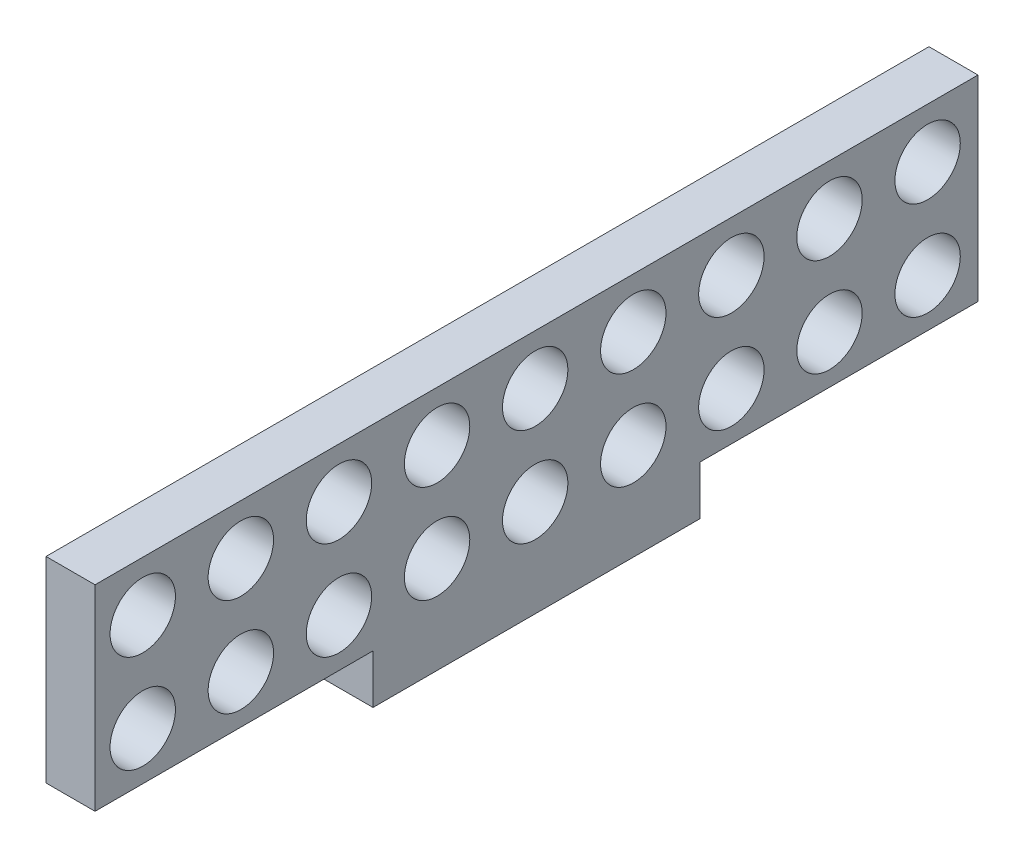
from build123d import *

# Parameters (mm, degrees)
SKETCH1_R           = 2
BOSS_EXTRUDE1_DEPTH = 3


with BuildPart() as part:
    # Sketch1 → Boss-Extrude1 (new body)
    with BuildSketch(Plane(origin=(0, 0, 0), x_dir=(0, 0, -1), z_dir=(1, 0, 0))):
        Polygon((-32.396036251, -4.056875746), (-49.396036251, -4.056875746), (-49.396036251, -7.056875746), (-69.396036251, -7.056875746), (-69.396036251, -4.056875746), (-86.396036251, -4.056875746), (-86.396036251, 7.943124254), (-32.396036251, 7.943124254), align=None)
        with Locations((-35.47869259, -1.123583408)):
            Circle(SKETCH1_R, mode=Mode.SUBTRACT)
        with Locations((-41.47869259, -1.123583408)):
            Circle(SKETCH1_R, mode=Mode.SUBTRACT)
        with Locations((-47.47869259, -1.123583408)):
            Circle(SKETCH1_R, mode=Mode.SUBTRACT)
        with Locations((-53.47869259, -1.123583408)):
            Circle(SKETCH1_R, mode=Mode.SUBTRACT)
        with Locations((-59.47869259, -1.123583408)):
            Circle(SKETCH1_R, mode=Mode.SUBTRACT)
        with Locations((-65.47869259, -1.123583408)):
            Circle(SKETCH1_R, mode=Mode.SUBTRACT)
        with Locations((-71.47869259, -1.123583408)):
            Circle(SKETCH1_R, mode=Mode.SUBTRACT)
        with Locations((-77.47869259, -1.123583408)):
            Circle(SKETCH1_R, mode=Mode.SUBTRACT)
        with Locations((-83.47869259, -1.123583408)):
            Circle(SKETCH1_R, mode=Mode.SUBTRACT)
        with Locations((-35.47869259, 4.876416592)):
            Circle(SKETCH1_R, mode=Mode.SUBTRACT)
        with Locations((-41.47869259, 4.876416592)):
            Circle(SKETCH1_R, mode=Mode.SUBTRACT)
        with Locations((-47.47869259, 4.876416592)):
            Circle(SKETCH1_R, mode=Mode.SUBTRACT)
        with Locations((-53.47869259, 4.876416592)):
            Circle(SKETCH1_R, mode=Mode.SUBTRACT)
        with Locations((-59.47869259, 4.876416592)):
            Circle(SKETCH1_R, mode=Mode.SUBTRACT)
        with Locations((-65.47869259, 4.876416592)):
            Circle(SKETCH1_R, mode=Mode.SUBTRACT)
        with Locations((-71.47869259, 4.876416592)):
            Circle(SKETCH1_R, mode=Mode.SUBTRACT)
        with Locations((-77.47869259, 4.876416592)):
            Circle(SKETCH1_R, mode=Mode.SUBTRACT)
        with Locations((-83.47869259, 4.876416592)):
            Circle(SKETCH1_R, mode=Mode.SUBTRACT)
    extrude(amount=BOSS_EXTRUDE1_DEPTH)


solid = part.part
